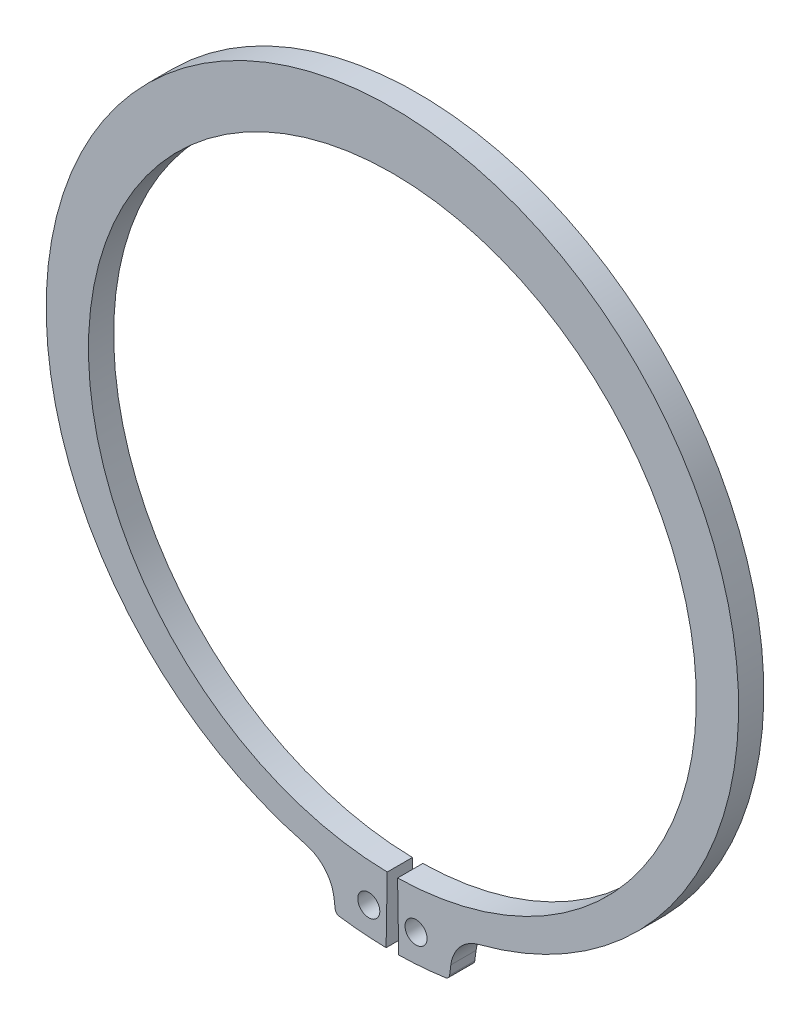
ISO-10303-21;
HEADER;
FILE_DESCRIPTION(('STEP AP214'),'2;1');
FILE_NAME('part.step','',(''),(''),'','','');
FILE_SCHEMA(('AUTOMOTIVE_DESIGN { 1 0 10303 214 1 1 1 1 }'));
ENDSEC;
DATA;
#1=APPLICATION_CONTEXT('core data for automotive mechanical design processes');
#2=APPLICATION_PROTOCOL_DEFINITION('international standard','automotive_design',2000,#1);
#3=PRODUCT_CONTEXT('',#1,'mechanical');
#4=PRODUCT('Part','Part','',(#3));
#5=PRODUCT_RELATED_PRODUCT_CATEGORY('part','',(#4));
#6=PRODUCT_DEFINITION_FORMATION('','',#4);
#7=PRODUCT_DEFINITION_CONTEXT('part definition',#1,'design');
#8=PRODUCT_DEFINITION('design','',#6,#7);
#9=PRODUCT_DEFINITION_SHAPE('','',#8);
#10=(LENGTH_UNIT() NAMED_UNIT(*) SI_UNIT(.MILLI.,.METRE.));
#11=(NAMED_UNIT(*) PLANE_ANGLE_UNIT() SI_UNIT($,.RADIAN.));
#12=(NAMED_UNIT(*) SI_UNIT($,.STERADIAN.) SOLID_ANGLE_UNIT());
#13=UNCERTAINTY_MEASURE_WITH_UNIT(LENGTH_MEASURE(1.E-05),#10,'distance_accuracy_value','');
#14=(GEOMETRIC_REPRESENTATION_CONTEXT(3) GLOBAL_UNCERTAINTY_ASSIGNED_CONTEXT((#13)) GLOBAL_UNIT_ASSIGNED_CONTEXT((#10,
#11,#12)) REPRESENTATION_CONTEXT('',''));
#15=CARTESIAN_POINT('',(0.,0.,0.));
#16=DIRECTION('',(0.,0.,1.));
#17=DIRECTION('',(1.,0.,0.));
#18=AXIS2_PLACEMENT_3D('',#15,#16,#17);
#19=CARTESIAN_POINT('',(0.,0.,-4.));
#20=DIRECTION('',(0.,0.,1.));
#21=DIRECTION('',(1.,0.,0.));
#22=AXIS2_PLACEMENT_3D('',#19,#20,#21);
#23=CYLINDRICAL_SURFACE('',#22,48.25);
#24=CARTESIAN_POINT('',(0.,0.,0.));
#25=DIRECTION('',(0.,0.,-1.));
#26=DIRECTION('',(1.,0.,0.));
#27=AXIS2_PLACEMENT_3D('',#24,#25,#26);
#28=CIRCLE('',#27,48.25);
#29=CARTESIAN_POINT('',(-0.821276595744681,-48.2430099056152,0.));
#30=VERTEX_POINT('',#29);
#31=CARTESIAN_POINT('',(0.821276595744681,-48.2430099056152,0.));
#32=VERTEX_POINT('',#31);
#33=EDGE_CURVE('E153',#30,#32,#28,.T.);
#34=ORIENTED_EDGE('',*,*,#33,.F.);
#35=DIRECTION('',(0.,0.,1.));
#36=VECTOR('',#35,1.);
#37=CARTESIAN_POINT('',(-0.821276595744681,-48.2430099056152,-4.));
#38=LINE('',#37,#36);
#39=CARTESIAN_POINT('',(-0.821276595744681,-48.2430099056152,-4.));
#40=VERTEX_POINT('',#39);
#41=EDGE_CURVE('E11',#40,#30,#38,.T.);
#42=ORIENTED_EDGE('',*,*,#41,.F.);
#43=CARTESIAN_POINT('',(0.,0.,-4.));
#44=DIRECTION('',(0.,0.,-1.));
#45=DIRECTION('',(1.,0.,0.));
#46=AXIS2_PLACEMENT_3D('',#43,#44,#45);
#47=CIRCLE('',#46,48.25);
#48=CARTESIAN_POINT('',(0.821276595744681,-48.2430099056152,-4.));
#49=VERTEX_POINT('',#48);
#50=EDGE_CURVE('E186',#40,#49,#47,.T.);
#51=ORIENTED_EDGE('',*,*,#50,.T.);
#52=DIRECTION('',(0.,0.,1.));
#53=VECTOR('',#52,1.);
#54=CARTESIAN_POINT('',(0.821276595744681,-48.2430099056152,-4.));
#55=LINE('',#54,#53);
#56=EDGE_CURVE('E35',#49,#32,#55,.T.);
#57=ORIENTED_EDGE('',*,*,#56,.T.);
#58=EDGE_LOOP('',(#34,#42,#51,#57));
#59=FACE_BOUND('',#58,.T.);
#60=ADVANCED_FACE('F32',(#59),#23,.F.);
#61=CARTESIAN_POINT('',(-0.821276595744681,-48.2430099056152,-4.));
#62=DIRECTION('',(0.999855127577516,-0.0170212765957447,0.));
#63=DIRECTION('',(0.0170212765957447,0.999855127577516,0.));
#64=AXIS2_PLACEMENT_3D('',#61,#62,#63);
#65=PLANE('',#64);
#66=DIRECTION('',(0.0170212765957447,0.999855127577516,0.));
#67=VECTOR('',#66,1.);
#68=CARTESIAN_POINT('',(-0.821276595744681,-48.2430099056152,0.));
#69=LINE('',#68,#67);
#70=CARTESIAN_POINT('',(-1.,-58.7414887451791,0.));
#71=VERTEX_POINT('',#70);
#72=EDGE_CURVE('E184',#71,#30,#69,.T.);
#73=ORIENTED_EDGE('',*,*,#72,.F.);
#74=DIRECTION('',(0.,0.,1.));
#75=VECTOR('',#74,1.);
#76=CARTESIAN_POINT('',(-1.,-58.7414887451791,-4.));
#77=LINE('',#76,#75);
#78=CARTESIAN_POINT('',(-1.,-58.7414887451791,-4.));
#79=VERTEX_POINT('',#78);
#80=EDGE_CURVE('E41',#79,#71,#77,.T.);
#81=ORIENTED_EDGE('',*,*,#80,.F.);
#82=DIRECTION('',(0.0170212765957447,0.999855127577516,0.));
#83=VECTOR('',#82,1.);
#84=CARTESIAN_POINT('',(-0.821276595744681,-48.2430099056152,-4.));
#85=LINE('',#84,#83);
#86=EDGE_CURVE('E143',#79,#40,#85,.T.);
#87=ORIENTED_EDGE('',*,*,#86,.T.);
#88=ORIENTED_EDGE('',*,*,#41,.T.);
#89=EDGE_LOOP('',(#73,#81,#87,#88));
#90=FACE_BOUND('',#89,.T.);
#91=ADVANCED_FACE('F206',(#90),#65,.T.);
#92=CARTESIAN_POINT('',(0.,0.,-4.));
#93=DIRECTION('',(0.,0.,1.));
#94=DIRECTION('',(1.,0.,0.));
#95=AXIS2_PLACEMENT_3D('',#92,#93,#94);
#96=CYLINDRICAL_SURFACE('',#95,58.75);
#97=CARTESIAN_POINT('',(0.,0.,0.));
#98=DIRECTION('',(0.,0.,1.));
#99=DIRECTION('',(1.,0.,0.));
#100=AXIS2_PLACEMENT_3D('',#97,#98,#99);
#101=CIRCLE('',#100,58.75);
#102=CARTESIAN_POINT('',(-8.44063102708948,-58.1405043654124,0.));
#103=VERTEX_POINT('',#102);
#104=EDGE_CURVE('E130',#103,#71,#101,.T.);
#105=ORIENTED_EDGE('',*,*,#104,.F.);
#106=DIRECTION('',(0.,0.,1.));
#107=VECTOR('',#106,1.);
#108=CARTESIAN_POINT('',(-8.44063102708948,-58.1405043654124,-4.));
#109=LINE('',#108,#107);
#110=CARTESIAN_POINT('',(-8.44063102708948,-58.1405043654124,-4.));
#111=VERTEX_POINT('',#110);
#112=EDGE_CURVE('E125',#111,#103,#109,.T.);
#113=ORIENTED_EDGE('',*,*,#112,.F.);
#114=CARTESIAN_POINT('',(0.,0.,-4.));
#115=DIRECTION('',(0.,0.,1.));
#116=DIRECTION('',(1.,0.,0.));
#117=AXIS2_PLACEMENT_3D('',#114,#115,#116);
#118=CIRCLE('',#117,58.75);
#119=EDGE_CURVE('E128',#111,#79,#118,.T.);
#120=ORIENTED_EDGE('',*,*,#119,.T.);
#121=ORIENTED_EDGE('',*,*,#80,.T.);
#122=EDGE_LOOP('',(#105,#113,#120,#121));
#123=FACE_BOUND('',#122,.T.);
#124=ADVANCED_FACE('F127',(#123),#96,.T.);
#125=CARTESIAN_POINT('',(-8.33287829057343,-57.3982851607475,-4.));
#126=DIRECTION('',(0.,0.,1.));
#127=DIRECTION('',(1.,0.,0.));
#128=AXIS2_PLACEMENT_3D('',#125,#126,#127);
#129=CYLINDRICAL_SURFACE('',#128,0.750000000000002);
#130=CARTESIAN_POINT('',(-8.33287829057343,-57.3982851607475,0.));
#131=DIRECTION('',(0.,0.,1.));
#132=DIRECTION('',(1.,0.,0.));
#133=AXIS2_PLACEMENT_3D('',#130,#131,#132);
#134=CIRCLE('',#133,0.750000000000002);
#135=CARTESIAN_POINT('',(-9.07646193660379,-57.4961798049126,0.));
#136=VERTEX_POINT('',#135);
#137=EDGE_CURVE('E181',#136,#103,#134,.T.);
#138=ORIENTED_EDGE('',*,*,#137,.F.);
#139=DIRECTION('',(0.,0.,1.));
#140=VECTOR('',#139,1.);
#141=CARTESIAN_POINT('',(-9.07646193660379,-57.4961798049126,-4.));
#142=LINE('',#141,#140);
#143=CARTESIAN_POINT('',(-9.07646193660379,-57.4961798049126,-4.));
#144=VERTEX_POINT('',#143);
#145=EDGE_CURVE('E135',#144,#136,#142,.T.);
#146=ORIENTED_EDGE('',*,*,#145,.F.);
#147=CARTESIAN_POINT('',(-8.33287829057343,-57.3982851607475,-4.));
#148=DIRECTION('',(0.,0.,1.));
#149=DIRECTION('',(1.,0.,0.));
#150=AXIS2_PLACEMENT_3D('',#147,#148,#149);
#151=CIRCLE('',#150,0.750000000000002);
#152=EDGE_CURVE('E141',#144,#111,#151,.T.);
#153=ORIENTED_EDGE('',*,*,#152,.T.);
#154=ORIENTED_EDGE('',*,*,#112,.T.);
#155=EDGE_LOOP('',(#138,#146,#153,#154));
#156=FACE_BOUND('',#155,.T.);
#157=ADVANCED_FACE('F145',(#156),#129,.T.);
#158=CARTESIAN_POINT('',(-9.27880258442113,-55.9592499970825,-4.));
#159=DIRECTION('',(-0.991444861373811,-0.130526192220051,0.));
#160=DIRECTION('',(0.130526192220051,-0.991444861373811,0.));
#161=AXIS2_PLACEMENT_3D('',#158,#159,#160);
#162=PLANE('',#161);
#163=DIRECTION('',(0.130526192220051,-0.99144486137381,0.));
#164=VECTOR('',#163,1.);
#165=CARTESIAN_POINT('',(-9.27880258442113,-55.9592499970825,0.));
#166=LINE('',#165,#164);
#167=CARTESIAN_POINT('',(-9.27880258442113,-55.9592499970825,0.));
#168=VERTEX_POINT('',#167);
#169=EDGE_CURVE('E178',#168,#136,#166,.T.);
#170=ORIENTED_EDGE('',*,*,#169,.F.);
#171=DIRECTION('',(0.,0.,1.));
#172=VECTOR('',#171,1.);
#173=CARTESIAN_POINT('',(-9.27880258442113,-55.9592499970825,-4.));
#174=LINE('',#173,#172);
#175=CARTESIAN_POINT('',(-9.27880258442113,-55.9592499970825,-4.));
#176=VERTEX_POINT('',#175);
#177=EDGE_CURVE('E190',#176,#168,#174,.T.);
#178=ORIENTED_EDGE('',*,*,#177,.F.);
#179=DIRECTION('',(0.130526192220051,-0.99144486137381,0.));
#180=VECTOR('',#179,1.);
#181=CARTESIAN_POINT('',(-9.27880258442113,-55.9592499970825,-4.));
#182=LINE('',#181,#180);
#183=EDGE_CURVE('E146',#176,#144,#182,.T.);
#184=ORIENTED_EDGE('',*,*,#183,.T.);
#185=ORIENTED_EDGE('',*,*,#145,.T.);
#186=EDGE_LOOP('',(#170,#178,#184,#185));
#187=FACE_BOUND('',#186,.T.);
#188=ADVANCED_FACE('F219',(#187),#162,.T.);
#189=CARTESIAN_POINT('',(-15.2271597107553,-56.7423660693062,-4.));
#190=DIRECTION('',(0.,0.,1.));
#191=DIRECTION('',(1.,0.,0.));
#192=AXIS2_PLACEMENT_3D('',#189,#190,#191);
#193=CYLINDRICAL_SURFACE('',#192,5.99968526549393);
#194=CARTESIAN_POINT('',(-15.2271597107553,-56.7423660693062,0.));
#195=DIRECTION('',(0.,0.,-1.));
#196=DIRECTION('',(1.,0.,0.));
#197=AXIS2_PLACEMENT_3D('',#194,#195,#196);
#198=CIRCLE('',#197,5.99968526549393);
#199=CARTESIAN_POINT('',(-13.7285562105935,-50.932855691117,0.));
#200=VERTEX_POINT('',#199);
#201=EDGE_CURVE('E175',#200,#168,#198,.T.);
#202=ORIENTED_EDGE('',*,*,#201,.F.);
#203=DIRECTION('',(0.,0.,1.));
#204=VECTOR('',#203,1.);
#205=CARTESIAN_POINT('',(-13.7285562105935,-50.932855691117,-4.));
#206=LINE('',#205,#204);
#207=CARTESIAN_POINT('',(-13.7285562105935,-50.932855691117,-4.));
#208=VERTEX_POINT('',#207);
#209=EDGE_CURVE('E192',#208,#200,#206,.T.);
#210=ORIENTED_EDGE('',*,*,#209,.F.);
#211=CARTESIAN_POINT('',(-15.2271597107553,-56.7423660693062,-4.));
#212=DIRECTION('',(0.,0.,-1.));
#213=DIRECTION('',(1.,0.,0.));
#214=AXIS2_PLACEMENT_3D('',#211,#212,#213);
#215=CIRCLE('',#214,5.99968526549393);
#216=EDGE_CURVE('E148',#208,#176,#215,.T.);
#217=ORIENTED_EDGE('',*,*,#216,.T.);
#218=ORIENTED_EDGE('',*,*,#177,.T.);
#219=EDGE_LOOP('',(#202,#210,#217,#218));
#220=FACE_BOUND('',#219,.T.);
#221=ADVANCED_FACE('F222',(#220),#193,.F.);
#222=CARTESIAN_POINT('',(0.,2.28748562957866,-4.));
#223=DIRECTION('',(0.,0.,1.));
#224=DIRECTION('',(1.,0.,0.));
#225=AXIS2_PLACEMENT_3D('',#222,#223,#224);
#226=CYLINDRICAL_SURFACE('',#225,54.9625143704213);
#227=CARTESIAN_POINT('',(0.,2.28748562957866,0.));
#228=DIRECTION('',(0.,0.,1.));
#229=DIRECTION('',(1.,0.,0.));
#230=AXIS2_PLACEMENT_3D('',#227,#228,#229);
#231=CIRCLE('',#230,54.9625143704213);
#232=CARTESIAN_POINT('',(13.7285562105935,-50.932855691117,0.));
#233=VERTEX_POINT('',#232);
#234=EDGE_CURVE('E172',#233,#200,#231,.T.);
#235=ORIENTED_EDGE('',*,*,#234,.F.);
#236=DIRECTION('',(0.,0.,1.));
#237=VECTOR('',#236,1.);
#238=CARTESIAN_POINT('',(13.7285562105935,-50.932855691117,-4.));
#239=LINE('',#238,#237);
#240=CARTESIAN_POINT('',(13.7285562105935,-50.932855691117,-4.));
#241=VERTEX_POINT('',#240);
#242=EDGE_CURVE('E194',#241,#233,#239,.T.);
#243=ORIENTED_EDGE('',*,*,#242,.F.);
#244=CARTESIAN_POINT('',(0.,2.28748562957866,-4.));
#245=DIRECTION('',(0.,0.,1.));
#246=DIRECTION('',(1.,0.,0.));
#247=AXIS2_PLACEMENT_3D('',#244,#245,#246);
#248=CIRCLE('',#247,54.9625143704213);
#249=EDGE_CURVE('E296',#241,#208,#248,.T.);
#250=ORIENTED_EDGE('',*,*,#249,.T.);
#251=ORIENTED_EDGE('',*,*,#209,.T.);
#252=EDGE_LOOP('',(#235,#243,#250,#251));
#253=FACE_BOUND('',#252,.T.);
#254=ADVANCED_FACE('F226',(#253),#226,.T.);
#255=CARTESIAN_POINT('',(15.2271597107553,-56.7423660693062,-4.));
#256=DIRECTION('',(0.,0.,1.));
#257=DIRECTION('',(1.,0.,0.));
#258=AXIS2_PLACEMENT_3D('',#255,#256,#257);
#259=CYLINDRICAL_SURFACE('',#258,5.99968526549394);
#260=CARTESIAN_POINT('',(15.2271597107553,-56.7423660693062,0.));
#261=DIRECTION('',(0.,0.,-1.));
#262=DIRECTION('',(1.,0.,0.));
#263=AXIS2_PLACEMENT_3D('',#260,#261,#262);
#264=CIRCLE('',#263,5.99968526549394);
#265=CARTESIAN_POINT('',(9.27880258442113,-55.9592499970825,0.));
#266=VERTEX_POINT('',#265);
#267=EDGE_CURVE('E169',#266,#233,#264,.T.);
#268=ORIENTED_EDGE('',*,*,#267,.F.);
#269=DIRECTION('',(0.,0.,1.));
#270=VECTOR('',#269,1.);
#271=CARTESIAN_POINT('',(9.27880258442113,-55.9592499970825,-4.));
#272=LINE('',#271,#270);
#273=CARTESIAN_POINT('',(9.27880258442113,-55.9592499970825,-4.));
#274=VERTEX_POINT('',#273);
#275=EDGE_CURVE('E196',#274,#266,#272,.T.);
#276=ORIENTED_EDGE('',*,*,#275,.F.);
#277=CARTESIAN_POINT('',(15.2271597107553,-56.7423660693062,-4.));
#278=DIRECTION('',(0.,0.,-1.));
#279=DIRECTION('',(1.,0.,0.));
#280=AXIS2_PLACEMENT_3D('',#277,#278,#279);
#281=CIRCLE('',#280,5.99968526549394);
#282=EDGE_CURVE('E293',#274,#241,#281,.T.);
#283=ORIENTED_EDGE('',*,*,#282,.T.);
#284=ORIENTED_EDGE('',*,*,#242,.T.);
#285=EDGE_LOOP('',(#268,#276,#283,#284));
#286=FACE_BOUND('',#285,.T.);
#287=ADVANCED_FACE('F230',(#286),#259,.F.);
#288=CARTESIAN_POINT('',(9.27880258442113,-55.9592499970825,-4.));
#289=DIRECTION('',(0.991444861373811,-0.130526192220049,0.));
#290=DIRECTION('',(0.130526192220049,0.991444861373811,0.));
#291=AXIS2_PLACEMENT_3D('',#288,#289,#290);
#292=PLANE('',#291);
#293=DIRECTION('',(0.130526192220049,0.991444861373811,0.));
#294=VECTOR('',#293,1.);
#295=CARTESIAN_POINT('',(9.27880258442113,-55.9592499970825,0.));
#296=LINE('',#295,#294);
#297=CARTESIAN_POINT('',(9.07646193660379,-57.4961798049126,0.));
#298=VERTEX_POINT('',#297);
#299=EDGE_CURVE('E166',#298,#266,#296,.T.);
#300=ORIENTED_EDGE('',*,*,#299,.F.);
#301=DIRECTION('',(0.,0.,1.));
#302=VECTOR('',#301,1.);
#303=CARTESIAN_POINT('',(9.07646193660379,-57.4961798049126,-4.));
#304=LINE('',#303,#302);
#305=CARTESIAN_POINT('',(9.07646193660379,-57.4961798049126,-4.));
#306=VERTEX_POINT('',#305);
#307=EDGE_CURVE('E198',#306,#298,#304,.T.);
#308=ORIENTED_EDGE('',*,*,#307,.F.);
#309=DIRECTION('',(0.130526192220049,0.991444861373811,0.));
#310=VECTOR('',#309,1.);
#311=CARTESIAN_POINT('',(9.27880258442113,-55.9592499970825,-4.));
#312=LINE('',#311,#310);
#313=EDGE_CURVE('E290',#306,#274,#312,.T.);
#314=ORIENTED_EDGE('',*,*,#313,.T.);
#315=ORIENTED_EDGE('',*,*,#275,.T.);
#316=EDGE_LOOP('',(#300,#308,#314,#315));
#317=FACE_BOUND('',#316,.T.);
#318=ADVANCED_FACE('F234',(#317),#292,.T.);
#319=CARTESIAN_POINT('',(8.33287829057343,-57.3982851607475,-4.));
#320=DIRECTION('',(0.,0.,1.));
#321=DIRECTION('',(1.,0.,0.));
#322=AXIS2_PLACEMENT_3D('',#319,#320,#321);
#323=CYLINDRICAL_SURFACE('',#322,0.750000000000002);
#324=CARTESIAN_POINT('',(8.33287829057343,-57.3982851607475,0.));
#325=DIRECTION('',(0.,0.,1.));
#326=DIRECTION('',(-1.,0.,0.));
#327=AXIS2_PLACEMENT_3D('',#324,#325,#326);
#328=CIRCLE('',#327,0.750000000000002);
#329=CARTESIAN_POINT('',(8.44063102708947,-58.1405043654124,0.));
#330=VERTEX_POINT('',#329);
#331=EDGE_CURVE('E163',#330,#298,#328,.T.);
#332=ORIENTED_EDGE('',*,*,#331,.F.);
#333=DIRECTION('',(0.,0.,1.));
#334=VECTOR('',#333,1.);
#335=CARTESIAN_POINT('',(8.44063102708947,-58.1405043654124,-4.));
#336=LINE('',#335,#334);
#337=CARTESIAN_POINT('',(8.44063102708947,-58.1405043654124,-4.));
#338=VERTEX_POINT('',#337);
#339=EDGE_CURVE('E200',#338,#330,#336,.T.);
#340=ORIENTED_EDGE('',*,*,#339,.F.);
#341=CARTESIAN_POINT('',(8.33287829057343,-57.3982851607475,-4.));
#342=DIRECTION('',(0.,0.,1.));
#343=DIRECTION('',(-1.,0.,0.));
#344=AXIS2_PLACEMENT_3D('',#341,#342,#343);
#345=CIRCLE('',#344,0.750000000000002);
#346=EDGE_CURVE('E287',#338,#306,#345,.T.);
#347=ORIENTED_EDGE('',*,*,#346,.T.);
#348=ORIENTED_EDGE('',*,*,#307,.T.);
#349=EDGE_LOOP('',(#332,#340,#347,#348));
#350=FACE_BOUND('',#349,.T.);
#351=ADVANCED_FACE('F238',(#350),#323,.T.);
#352=CARTESIAN_POINT('',(0.,0.,-4.));
#353=DIRECTION('',(0.,0.,1.));
#354=DIRECTION('',(1.,0.,0.));
#355=AXIS2_PLACEMENT_3D('',#352,#353,#354);
#356=CYLINDRICAL_SURFACE('',#355,58.75);
#357=CARTESIAN_POINT('',(0.,0.,0.));
#358=DIRECTION('',(0.,0.,1.));
#359=DIRECTION('',(1.,0.,0.));
#360=AXIS2_PLACEMENT_3D('',#357,#358,#359);
#361=CIRCLE('',#360,58.75);
#362=CARTESIAN_POINT('',(0.999999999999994,-58.7414887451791,0.));
#363=VERTEX_POINT('',#362);
#364=EDGE_CURVE('E160',#363,#330,#361,.T.);
#365=ORIENTED_EDGE('',*,*,#364,.F.);
#366=DIRECTION('',(0.,0.,1.));
#367=VECTOR('',#366,1.);
#368=CARTESIAN_POINT('',(0.999999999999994,-58.7414887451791,-4.));
#369=LINE('',#368,#367);
#370=CARTESIAN_POINT('',(0.999999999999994,-58.7414887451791,-4.));
#371=VERTEX_POINT('',#370);
#372=EDGE_CURVE('E201',#371,#363,#369,.T.);
#373=ORIENTED_EDGE('',*,*,#372,.F.);
#374=CARTESIAN_POINT('',(0.,0.,-4.));
#375=DIRECTION('',(0.,0.,1.));
#376=DIRECTION('',(1.,0.,0.));
#377=AXIS2_PLACEMENT_3D('',#374,#375,#376);
#378=CIRCLE('',#377,58.75);
#379=EDGE_CURVE('E284',#371,#338,#378,.T.);
#380=ORIENTED_EDGE('',*,*,#379,.T.);
#381=ORIENTED_EDGE('',*,*,#339,.T.);
#382=EDGE_LOOP('',(#365,#373,#380,#381));
#383=FACE_BOUND('',#382,.T.);
#384=ADVANCED_FACE('F242',(#383),#356,.T.);
#385=CARTESIAN_POINT('',(0.821276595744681,-48.2430099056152,-4.));
#386=DIRECTION('',(-0.999855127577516,-0.0170212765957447,0.));
#387=DIRECTION('',(0.0170212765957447,-0.999855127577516,0.));
#388=AXIS2_PLACEMENT_3D('',#385,#386,#387);
#389=PLANE('',#388);
#390=DIRECTION('',(0.0170212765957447,-0.999855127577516,0.));
#391=VECTOR('',#390,1.);
#392=CARTESIAN_POINT('',(0.821276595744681,-48.2430099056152,0.));
#393=LINE('',#392,#391);
#394=EDGE_CURVE('E156',#32,#363,#393,.T.);
#395=ORIENTED_EDGE('',*,*,#394,.F.);
#396=ORIENTED_EDGE('',*,*,#56,.F.);
#397=DIRECTION('',(0.0170212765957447,-0.999855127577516,0.));
#398=VECTOR('',#397,1.);
#399=CARTESIAN_POINT('',(0.821276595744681,-48.2430099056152,-4.));
#400=LINE('',#399,#398);
#401=EDGE_CURVE('E282',#49,#371,#400,.T.);
#402=ORIENTED_EDGE('',*,*,#401,.T.);
#403=ORIENTED_EDGE('',*,*,#372,.T.);
#404=EDGE_LOOP('',(#395,#396,#402,#403));
#405=FACE_BOUND('',#404,.T.);
#406=ADVANCED_FACE('F203',(#405),#389,.T.);
#407=CARTESIAN_POINT('',(0.,0.,-4.));
#408=DIRECTION('',(0.,0.,1.));
#409=DIRECTION('',(1.,0.,0.));
#410=AXIS2_PLACEMENT_3D('',#407,#408,#409);
#411=PLANE('',#410);
#412=CARTESIAN_POINT('',(-3.75,-54.2455355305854,-4.));
#413=DIRECTION('',(0.,0.,1.));
#414=DIRECTION('',(1.,0.,0.));
#415=AXIS2_PLACEMENT_3D('',#412,#413,#414);
#416=CIRCLE('',#415,1.75);
#417=CARTESIAN_POINT('',(-2.,-54.2455355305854,-4.));
#418=VERTEX_POINT('',#417);
#419=EDGE_CURVE('E269',#418,#418,#416,.T.);
#420=ORIENTED_EDGE('',*,*,#419,.T.);
#421=EDGE_LOOP('',(#420));
#422=FACE_BOUND('',#421,.T.);
#423=CARTESIAN_POINT('',(3.75,-54.2455355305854,-4.));
#424=DIRECTION('',(0.,0.,1.));
#425=DIRECTION('',(1.,0.,0.));
#426=AXIS2_PLACEMENT_3D('',#423,#424,#425);
#427=CIRCLE('',#426,1.75);
#428=CARTESIAN_POINT('',(5.5,-54.2455355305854,-4.));
#429=VERTEX_POINT('',#428);
#430=EDGE_CURVE('E157',#429,#429,#427,.T.);
#431=ORIENTED_EDGE('',*,*,#430,.T.);
#432=EDGE_LOOP('',(#431));
#433=FACE_BOUND('',#432,.T.);
#434=ORIENTED_EDGE('',*,*,#50,.F.);
#435=ORIENTED_EDGE('',*,*,#86,.F.);
#436=ORIENTED_EDGE('',*,*,#119,.F.);
#437=ORIENTED_EDGE('',*,*,#152,.F.);
#438=ORIENTED_EDGE('',*,*,#183,.F.);
#439=ORIENTED_EDGE('',*,*,#216,.F.);
#440=ORIENTED_EDGE('',*,*,#249,.F.);
#441=ORIENTED_EDGE('',*,*,#282,.F.);
#442=ORIENTED_EDGE('',*,*,#313,.F.);
#443=ORIENTED_EDGE('',*,*,#346,.F.);
#444=ORIENTED_EDGE('',*,*,#379,.F.);
#445=ORIENTED_EDGE('',*,*,#401,.F.);
#446=EDGE_LOOP('',(#434,#435,#436,#437,#438,#439,#440,#441,#442,#443,#444,#445));
#447=FACE_BOUND('',#446,.T.);
#448=ADVANCED_FACE('F139',(#422,#433,#447),#411,.F.);
#449=CARTESIAN_POINT('',(0.,0.,0.));
#450=DIRECTION('',(0.,0.,1.));
#451=DIRECTION('',(1.,0.,0.));
#452=AXIS2_PLACEMENT_3D('',#449,#450,#451);
#453=PLANE('',#452);
#454=CARTESIAN_POINT('',(-3.75,-54.2455355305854,0.));
#455=DIRECTION('',(0.,0.,1.));
#456=DIRECTION('',(1.,0.,0.));
#457=AXIS2_PLACEMENT_3D('',#454,#455,#456);
#458=CIRCLE('',#457,1.75);
#459=CARTESIAN_POINT('',(-2.,-54.2455355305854,0.));
#460=VERTEX_POINT('',#459);
#461=EDGE_CURVE('E272',#460,#460,#458,.T.);
#462=ORIENTED_EDGE('',*,*,#461,.F.);
#463=EDGE_LOOP('',(#462));
#464=FACE_BOUND('',#463,.T.);
#465=CARTESIAN_POINT('',(3.75,-54.2455355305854,0.));
#466=DIRECTION('',(0.,0.,1.));
#467=DIRECTION('',(1.,0.,0.));
#468=AXIS2_PLACEMENT_3D('',#465,#466,#467);
#469=CIRCLE('',#468,1.75);
#470=CARTESIAN_POINT('',(5.5,-54.2455355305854,0.));
#471=VERTEX_POINT('',#470);
#472=EDGE_CURVE('E274',#471,#471,#469,.T.);
#473=ORIENTED_EDGE('',*,*,#472,.F.);
#474=EDGE_LOOP('',(#473));
#475=FACE_BOUND('',#474,.T.);
#476=ORIENTED_EDGE('',*,*,#33,.T.);
#477=ORIENTED_EDGE('',*,*,#394,.T.);
#478=ORIENTED_EDGE('',*,*,#364,.T.);
#479=ORIENTED_EDGE('',*,*,#331,.T.);
#480=ORIENTED_EDGE('',*,*,#299,.T.);
#481=ORIENTED_EDGE('',*,*,#267,.T.);
#482=ORIENTED_EDGE('',*,*,#234,.T.);
#483=ORIENTED_EDGE('',*,*,#201,.T.);
#484=ORIENTED_EDGE('',*,*,#169,.T.);
#485=ORIENTED_EDGE('',*,*,#137,.T.);
#486=ORIENTED_EDGE('',*,*,#104,.T.);
#487=ORIENTED_EDGE('',*,*,#72,.T.);
#488=EDGE_LOOP('',(#476,#477,#478,#479,#480,#481,#482,#483,#484,#485,#486,#487));
#489=FACE_BOUND('',#488,.T.);
#490=ADVANCED_FACE('F205',(#464,#475,#489),#453,.T.);
#491=CARTESIAN_POINT('',(3.75,-54.2455355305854,-4.));
#492=DIRECTION('',(0.,0.,1.));
#493=DIRECTION('',(1.,0.,0.));
#494=AXIS2_PLACEMENT_3D('',#491,#492,#493);
#495=CYLINDRICAL_SURFACE('',#494,1.75);
#496=ORIENTED_EDGE('',*,*,#430,.F.);
#497=EDGE_LOOP('',(#496));
#498=FACE_BOUND('',#497,.T.);
#499=ORIENTED_EDGE('',*,*,#472,.T.);
#500=EDGE_LOOP('',(#499));
#501=FACE_BOUND('',#500,.T.);
#502=ADVANCED_FACE('F254',(#498,#501),#495,.F.);
#503=CARTESIAN_POINT('',(-3.75,-54.2455355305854,-4.));
#504=DIRECTION('',(0.,0.,1.));
#505=DIRECTION('',(1.,0.,0.));
#506=AXIS2_PLACEMENT_3D('',#503,#504,#505);
#507=CYLINDRICAL_SURFACE('',#506,1.75);
#508=ORIENTED_EDGE('',*,*,#419,.F.);
#509=EDGE_LOOP('',(#508));
#510=FACE_BOUND('',#509,.T.);
#511=ORIENTED_EDGE('',*,*,#461,.T.);
#512=EDGE_LOOP('',(#511));
#513=FACE_BOUND('',#512,.T.);
#514=ADVANCED_FACE('F261',(#510,#513),#507,.F.);
#515=CLOSED_SHELL('',(#60,#91,#124,#157,#188,#221,#254,#287,#318,#351,#384,#406,#448,#490,#502,#514));
#516=MANIFOLD_SOLID_BREP('B2',#515);
#517=ADVANCED_BREP_SHAPE_REPRESENTATION('',(#18,#516),#14);
#518=SHAPE_DEFINITION_REPRESENTATION(#9,#517);
ENDSEC;
END-ISO-10303-21;
